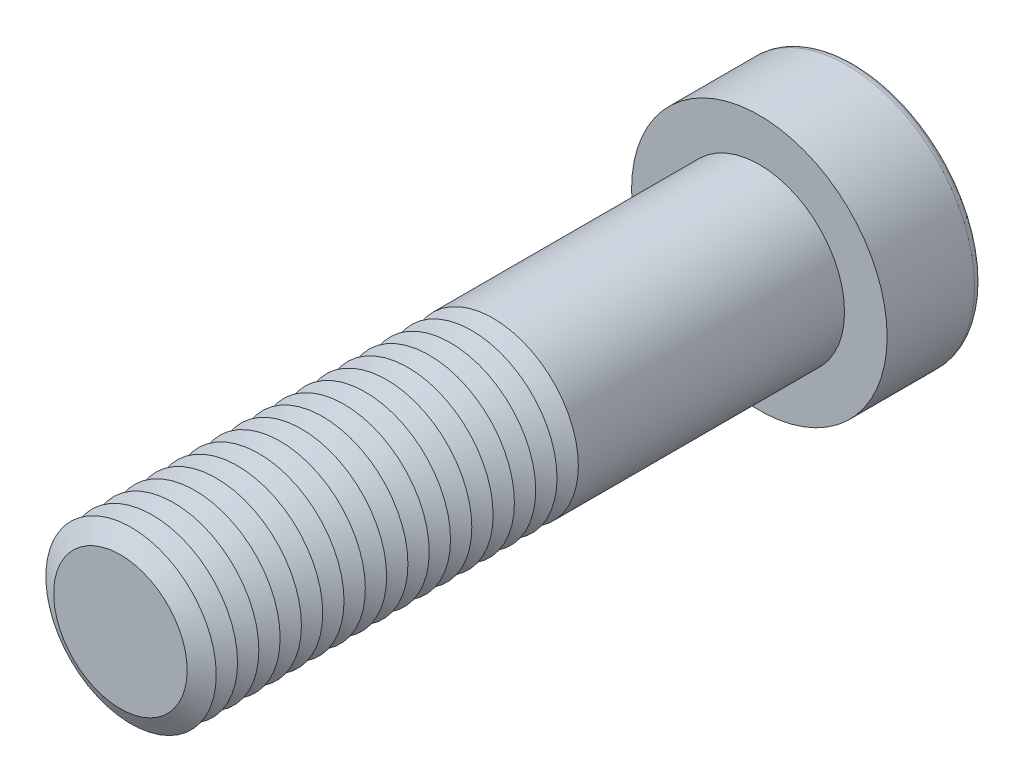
from build123d import *

# Parameters (mm, degrees)
SKETCH1_R           = 8
BOSS_EXTRUDE1_DEPTH = 60
SKETCH2_R           = 12
BOSS_EXTRUDE2_DEPTH = 9
CUT_EXTRUDE1_DEPTH  = 9
FILLET1_R           = 0.8
LPATTERN1_COUNT     = 18
LPATTERN1_PITCH     = 2


with BuildPart() as part:
    # Sketch1 → Boss-Extrude1 (new body)
    with BuildSketch(Plane.XY):
        Circle(SKETCH1_R)
    extrude(amount=BOSS_EXTRUDE1_DEPTH)

    # Sketch2 → Boss-Extrude2 (add)
    with BuildSketch(Plane(origin=(0, 0, 0), x_dir=(-1, 0, 0), z_dir=(0, 0, -1))):
        Circle(SKETCH2_R)
    extrude(amount=BOSS_EXTRUDE2_DEPTH)

    # Sketch3 → Cut-Extrude1 (cut)
    with BuildSketch(Plane(origin=(0, 0, -9), x_dir=(-1, 0, 0), z_dir=(0, 0, -1))):
        Polygon((-3.464101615, 6), (-6.92820323, 0), (-3.464101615, -6), (3.464101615, -6), (6.92820323, 0), (3.464101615, 6), align=None)
    extrude(amount=-CUT_EXTRUDE1_DEPTH, mode=Mode.SUBTRACT)

    # Fillet1
    fillet1_edges = [part.edges().sort_by_distance(p)[0] for p in [
        (12, 0, -9),
    ]]
    fillet(fillet1_edges, radius=FILLET1_R)

    # Cut-Extrude2 cone 1 section (on through the dimple's axis) → Cut-Extrude2 (revolve, cut)
    with BuildSketch(Plane.YZ):
        Polygon((0, 0), (6, 0), (0, 3.464101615), align=None)
    revolve(axis=Axis((0, 0, 0), (0, 0, 1)), mode=Mode.SUBTRACT)

    # Cut-Extrude3 cone 1 section (on through the dimple's axis) → Cut-Extrude3 (revolve, cut)
    with BuildSketch(Plane(origin=(0, 0, -9), x_dir=(0, 1, 0), z_dir=(1, 0, 0))):
        Polygon((0, 0), (6.92820323, 0), (0, 1.856406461), align=None)
    revolve(axis=Axis((0, 0, -9), (0, 0, 1)), mode=Mode.SUBTRACT)

    # Sketch7 → Cut-Revolve1 (revolve, cut)
    with BuildSketch(Plane(origin=(0, 0, 0), x_dir=(0, 0, -1), z_dir=(1, 0, 0)), mode=Mode.PRIVATE) as cut_revolve1_sk:
        Polygon((-60, 6.267949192), (-59, 8), (-61, 8), align=None)
    cut_revolve1 = revolve(cut_revolve1_sk.sketch.rotate(Axis((0, 0, 60), (0, 0, -1)), 90), axis=Axis((0, 0, 60), (0, 0, -1)), mode=Mode.SUBTRACT)

    # LPattern1: Cut-Revolve1 ×18
    with Locations(*[(0, 0, -i * LPATTERN1_PITCH) for i in range(1, LPATTERN1_COUNT)]):
        add(cut_revolve1, mode=Mode.SUBTRACT)


solid = part.part
